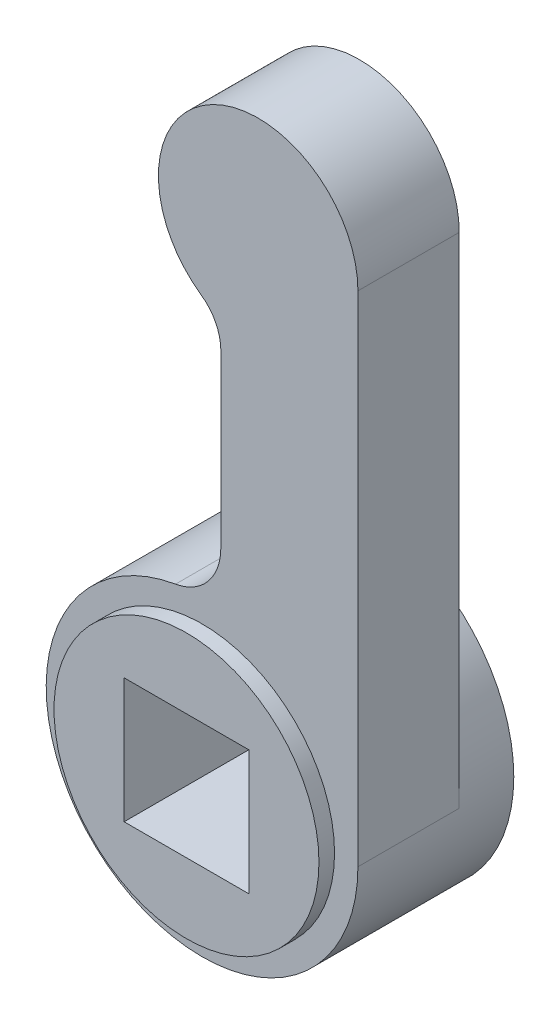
ISO-10303-21;
HEADER;
FILE_DESCRIPTION(('STEP AP214'),'2;1');
FILE_NAME('part.step','',(''),(''),'','','');
FILE_SCHEMA(('AUTOMOTIVE_DESIGN { 1 0 10303 214 1 1 1 1 }'));
ENDSEC;
DATA;
#1=APPLICATION_CONTEXT('core data for automotive mechanical design processes');
#2=APPLICATION_PROTOCOL_DEFINITION('international standard','automotive_design',2000,#1);
#3=PRODUCT_CONTEXT('',#1,'mechanical');
#4=PRODUCT('Part','Part','',(#3));
#5=PRODUCT_RELATED_PRODUCT_CATEGORY('part','',(#4));
#6=PRODUCT_DEFINITION_FORMATION('','',#4);
#7=PRODUCT_DEFINITION_CONTEXT('part definition',#1,'design');
#8=PRODUCT_DEFINITION('design','',#6,#7);
#9=PRODUCT_DEFINITION_SHAPE('','',#8);
#10=(LENGTH_UNIT() NAMED_UNIT(*) SI_UNIT(.MILLI.,.METRE.));
#11=(NAMED_UNIT(*) PLANE_ANGLE_UNIT() SI_UNIT($,.RADIAN.));
#12=(NAMED_UNIT(*) SI_UNIT($,.STERADIAN.) SOLID_ANGLE_UNIT());
#13=UNCERTAINTY_MEASURE_WITH_UNIT(LENGTH_MEASURE(1.E-05),#10,'distance_accuracy_value','');
#14=(GEOMETRIC_REPRESENTATION_CONTEXT(3) GLOBAL_UNCERTAINTY_ASSIGNED_CONTEXT((#13)) GLOBAL_UNIT_ASSIGNED_CONTEXT((#10,
#11,#12)) REPRESENTATION_CONTEXT('',''));
#15=CARTESIAN_POINT('',(0.,0.,0.));
#16=DIRECTION('',(0.,0.,1.));
#17=DIRECTION('',(1.,0.,0.));
#18=AXIS2_PLACEMENT_3D('',#15,#16,#17);
#19=CARTESIAN_POINT('',(0.,0.,5.));
#20=DIRECTION('',(0.,0.,1.));
#21=DIRECTION('',(1.,0.,0.));
#22=AXIS2_PLACEMENT_3D('',#19,#20,#21);
#23=PLANE('',#22);
#24=CARTESIAN_POINT('',(0.,0.,5.));
#25=DIRECTION('',(0.,0.,1.));
#26=DIRECTION('',(1.,0.,0.));
#27=AXIS2_PLACEMENT_3D('',#24,#25,#26);
#28=CIRCLE('',#27,10.);
#29=CARTESIAN_POINT('',(-1.7009795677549,9.85427158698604,5.));
#30=VERTEX_POINT('',#29);
#31=CARTESIAN_POINT('',(10.,0.,5.));
#32=VERTEX_POINT('',#31);
#33=EDGE_CURVE('E38',#30,#32,#28,.T.);
#34=ORIENTED_EDGE('',*,*,#33,.T.);
#35=DIRECTION('',(0.,1.,0.));
#36=VECTOR('',#35,1.);
#37=CARTESIAN_POINT('',(10.,0.,5.));
#38=LINE('',#37,#36);
#39=CARTESIAN_POINT('',(9.99999999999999,32.,5.));
#40=VERTEX_POINT('',#39);
#41=EDGE_CURVE('E159',#32,#40,#38,.T.);
#42=ORIENTED_EDGE('',*,*,#41,.T.);
#43=CARTESIAN_POINT('',(3.59999999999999,32.,5.));
#44=DIRECTION('',(0.,0.,1.));
#45=DIRECTION('',(-1.,0.,0.));
#46=AXIS2_PLACEMENT_3D('',#43,#44,#45);
#47=CIRCLE('',#46,6.4);
#48=CARTESIAN_POINT('',(-0.0740918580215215,26.759670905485,5.));
#49=VERTEX_POINT('',#48);
#50=EDGE_CURVE('E162',#40,#49,#47,.T.);
#51=ORIENTED_EDGE('',*,*,#50,.T.);
#52=CARTESIAN_POINT('',(-1.79632241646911,24.3032666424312,5.));
#53=DIRECTION('',(0.,0.,-1.));
#54=DIRECTION('',(1.,0.,0.));
#55=AXIS2_PLACEMENT_3D('',#52,#53,#54);
#56=CIRCLE('',#55,3.);
#57=CARTESIAN_POINT('',(1.20367758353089,24.3032666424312,5.));
#58=VERTEX_POINT('',#57);
#59=EDGE_CURVE('E165',#49,#58,#56,.T.);
#60=ORIENTED_EDGE('',*,*,#59,.T.);
#61=DIRECTION('',(0.,-1.,0.));
#62=VECTOR('',#61,1.);
#63=CARTESIAN_POINT('',(1.20367758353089,13.3032666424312,5.));
#64=LINE('',#63,#62);
#65=CARTESIAN_POINT('',(1.20367758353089,13.3032666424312,5.));
#66=VERTEX_POINT('',#65);
#67=EDGE_CURVE('E168',#58,#66,#64,.T.);
#68=ORIENTED_EDGE('',*,*,#67,.T.);
#69=CARTESIAN_POINT('',(-2.29632241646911,13.3032666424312,5.));
#70=DIRECTION('',(0.,0.,-1.));
#71=DIRECTION('',(1.,0.,0.));
#72=AXIS2_PLACEMENT_3D('',#69,#70,#71);
#73=CIRCLE('',#72,3.5);
#74=EDGE_CURVE('E45',#66,#30,#73,.T.);
#75=ORIENTED_EDGE('',*,*,#74,.T.);
#76=EDGE_LOOP('',(#34,#42,#51,#60,#68,#75));
#77=FACE_BOUND('',#76,.T.);
#78=CARTESIAN_POINT('',(0.,0.,5.));
#79=DIRECTION('',(0.,0.,1.));
#80=DIRECTION('',(1.,0.,0.));
#81=AXIS2_PLACEMENT_3D('',#78,#79,#80);
#82=CIRCLE('',#81,8.5);
#83=CARTESIAN_POINT('',(8.5,0.,5.));
#84=VERTEX_POINT('',#83);
#85=EDGE_CURVE('E154',#84,#84,#82,.F.);
#86=ORIENTED_EDGE('',*,*,#85,.T.);
#87=EDGE_LOOP('',(#86));
#88=FACE_BOUND('',#87,.T.);
#89=ADVANCED_FACE('F30',(#77,#88),#23,.T.);
#90=CARTESIAN_POINT('',(0.,0.,-5.));
#91=DIRECTION('',(0.,0.,1.));
#92=DIRECTION('',(1.,0.,0.));
#93=AXIS2_PLACEMENT_3D('',#90,#91,#92);
#94=PLANE('',#93);
#95=CARTESIAN_POINT('',(0.,0.,-5.));
#96=DIRECTION('',(0.,0.,1.));
#97=DIRECTION('',(1.,0.,0.));
#98=AXIS2_PLACEMENT_3D('',#95,#96,#97);
#99=CIRCLE('',#98,10.);
#100=CARTESIAN_POINT('',(10.,0.,-5.));
#101=VERTEX_POINT('',#100);
#102=EDGE_CURVE('E122',#101,#101,#99,.T.);
#103=ORIENTED_EDGE('',*,*,#102,.F.);
#104=EDGE_LOOP('',(#103));
#105=FACE_BOUND('',#104,.T.);
#106=CARTESIAN_POINT('',(0.,0.,-5.));
#107=DIRECTION('',(0.,0.,1.));
#108=DIRECTION('',(1.,0.,0.));
#109=AXIS2_PLACEMENT_3D('',#106,#107,#108);
#110=CIRCLE('',#109,8.5);
#111=CARTESIAN_POINT('',(8.5,0.,-5.));
#112=VERTEX_POINT('',#111);
#113=EDGE_CURVE('E11',#112,#112,#110,.F.);
#114=ORIENTED_EDGE('',*,*,#113,.F.);
#115=EDGE_LOOP('',(#114));
#116=FACE_BOUND('',#115,.T.);
#117=ADVANCED_FACE('F208',(#105,#116),#94,.F.);
#118=CARTESIAN_POINT('',(0.,0.,5.));
#119=DIRECTION('',(0.,0.,-1.));
#120=DIRECTION('',(-1.,0.,0.));
#121=AXIS2_PLACEMENT_3D('',#118,#119,#120);
#122=CYLINDRICAL_SURFACE('',#121,10.);
#123=ORIENTED_EDGE('',*,*,#102,.T.);
#124=EDGE_LOOP('',(#123));
#125=FACE_BOUND('',#124,.T.);
#126=DIRECTION('',(0.,0.,1.));
#127=VECTOR('',#126,1.);
#128=CARTESIAN_POINT('',(-1.7009795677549,9.85427158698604,-1.5));
#129=LINE('',#128,#127);
#130=CARTESIAN_POINT('',(-1.7009795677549,9.85427158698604,-1.5));
#131=VERTEX_POINT('',#130);
#132=EDGE_CURVE('E187',#131,#30,#129,.T.);
#133=ORIENTED_EDGE('',*,*,#132,.F.);
#134=CARTESIAN_POINT('',(0.,0.,-1.5));
#135=DIRECTION('',(0.,0.,-1.));
#136=DIRECTION('',(-1.,0.,0.));
#137=AXIS2_PLACEMENT_3D('',#134,#135,#136);
#138=CIRCLE('',#137,10.);
#139=CARTESIAN_POINT('',(10.,0.,-1.5));
#140=VERTEX_POINT('',#139);
#141=EDGE_CURVE('E53',#131,#140,#138,.T.);
#142=ORIENTED_EDGE('',*,*,#141,.T.);
#143=DIRECTION('',(0.,0.,1.));
#144=VECTOR('',#143,1.);
#145=CARTESIAN_POINT('',(10.,0.,-1.5));
#146=LINE('',#145,#144);
#147=EDGE_CURVE('E186',#140,#32,#146,.T.);
#148=ORIENTED_EDGE('',*,*,#147,.T.);
#149=ORIENTED_EDGE('',*,*,#33,.F.);
#150=EDGE_LOOP('',(#133,#142,#148,#149));
#151=FACE_BOUND('',#150,.T.);
#152=ADVANCED_FACE('F32',(#125,#151),#122,.T.);
#153=CARTESIAN_POINT('',(-2.29632241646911,13.3032666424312,-1.5));
#154=DIRECTION('',(0.,0.,1.));
#155=DIRECTION('',(1.,0.,0.));
#156=AXIS2_PLACEMENT_3D('',#153,#154,#155);
#157=CYLINDRICAL_SURFACE('',#156,3.5);
#158=ORIENTED_EDGE('',*,*,#132,.T.);
#159=ORIENTED_EDGE('',*,*,#74,.F.);
#160=DIRECTION('',(0.,0.,1.));
#161=VECTOR('',#160,1.);
#162=CARTESIAN_POINT('',(1.20367758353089,13.3032666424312,-1.5));
#163=LINE('',#162,#161);
#164=CARTESIAN_POINT('',(1.20367758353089,13.3032666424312,-1.5));
#165=VERTEX_POINT('',#164);
#166=EDGE_CURVE('E189',#165,#66,#163,.T.);
#167=ORIENTED_EDGE('',*,*,#166,.F.);
#168=CARTESIAN_POINT('',(-2.29632241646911,13.3032666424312,-1.5));
#169=DIRECTION('',(0.,0.,-1.));
#170=DIRECTION('',(1.,0.,0.));
#171=AXIS2_PLACEMENT_3D('',#168,#169,#170);
#172=CIRCLE('',#171,3.5);
#173=EDGE_CURVE('E184',#165,#131,#172,.T.);
#174=ORIENTED_EDGE('',*,*,#173,.T.);
#175=EDGE_LOOP('',(#158,#159,#167,#174));
#176=FACE_BOUND('',#175,.T.);
#177=ADVANCED_FACE('F264',(#176),#157,.F.);
#178=CARTESIAN_POINT('',(1.20367758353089,13.3032666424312,-1.5));
#179=DIRECTION('',(-1.,0.,0.));
#180=DIRECTION('',(0.,0.,1.));
#181=AXIS2_PLACEMENT_3D('',#178,#179,#180);
#182=PLANE('',#181);
#183=ORIENTED_EDGE('',*,*,#166,.T.);
#184=ORIENTED_EDGE('',*,*,#67,.F.);
#185=DIRECTION('',(0.,0.,1.));
#186=VECTOR('',#185,1.);
#187=CARTESIAN_POINT('',(1.20367758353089,24.3032666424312,-1.5));
#188=LINE('',#187,#186);
#189=CARTESIAN_POINT('',(1.20367758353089,24.3032666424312,-1.5));
#190=VERTEX_POINT('',#189);
#191=EDGE_CURVE('E191',#190,#58,#188,.T.);
#192=ORIENTED_EDGE('',*,*,#191,.F.);
#193=DIRECTION('',(0.,-1.,0.));
#194=VECTOR('',#193,1.);
#195=CARTESIAN_POINT('',(1.20367758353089,13.3032666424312,-1.5));
#196=LINE('',#195,#194);
#197=EDGE_CURVE('E181',#190,#165,#196,.T.);
#198=ORIENTED_EDGE('',*,*,#197,.T.);
#199=EDGE_LOOP('',(#183,#184,#192,#198));
#200=FACE_BOUND('',#199,.T.);
#201=ADVANCED_FACE('F260',(#200),#182,.T.);
#202=CARTESIAN_POINT('',(-1.79632241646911,24.3032666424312,-1.5));
#203=DIRECTION('',(0.,0.,1.));
#204=DIRECTION('',(1.,0.,0.));
#205=AXIS2_PLACEMENT_3D('',#202,#203,#204);
#206=CYLINDRICAL_SURFACE('',#205,3.);
#207=ORIENTED_EDGE('',*,*,#191,.T.);
#208=ORIENTED_EDGE('',*,*,#59,.F.);
#209=DIRECTION('',(0.,0.,1.));
#210=VECTOR('',#209,1.);
#211=CARTESIAN_POINT('',(-0.0740918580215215,26.759670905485,-1.5));
#212=LINE('',#211,#210);
#213=CARTESIAN_POINT('',(-0.0740918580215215,26.759670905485,-1.5));
#214=VERTEX_POINT('',#213);
#215=EDGE_CURVE('E193',#214,#49,#212,.T.);
#216=ORIENTED_EDGE('',*,*,#215,.F.);
#217=CARTESIAN_POINT('',(-1.79632241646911,24.3032666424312,-1.5));
#218=DIRECTION('',(0.,0.,-1.));
#219=DIRECTION('',(1.,0.,0.));
#220=AXIS2_PLACEMENT_3D('',#217,#218,#219);
#221=CIRCLE('',#220,3.);
#222=EDGE_CURVE('E178',#214,#190,#221,.T.);
#223=ORIENTED_EDGE('',*,*,#222,.T.);
#224=EDGE_LOOP('',(#207,#208,#216,#223));
#225=FACE_BOUND('',#224,.T.);
#226=ADVANCED_FACE('F256',(#225),#206,.F.);
#227=CARTESIAN_POINT('',(3.59999999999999,32.,-1.5));
#228=DIRECTION('',(0.,0.,1.));
#229=DIRECTION('',(1.,0.,0.));
#230=AXIS2_PLACEMENT_3D('',#227,#228,#229);
#231=CYLINDRICAL_SURFACE('',#230,6.4);
#232=ORIENTED_EDGE('',*,*,#215,.T.);
#233=ORIENTED_EDGE('',*,*,#50,.F.);
#234=DIRECTION('',(0.,0.,1.));
#235=VECTOR('',#234,1.);
#236=CARTESIAN_POINT('',(9.99999999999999,32.,-1.5));
#237=LINE('',#236,#235);
#238=CARTESIAN_POINT('',(9.99999999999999,32.,-1.5));
#239=VERTEX_POINT('',#238);
#240=EDGE_CURVE('E195',#239,#40,#237,.T.);
#241=ORIENTED_EDGE('',*,*,#240,.F.);
#242=CARTESIAN_POINT('',(3.59999999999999,32.,-1.5));
#243=DIRECTION('',(0.,0.,1.));
#244=DIRECTION('',(-1.,0.,0.));
#245=AXIS2_PLACEMENT_3D('',#242,#243,#244);
#246=CIRCLE('',#245,6.4);
#247=EDGE_CURVE('E175',#239,#214,#246,.T.);
#248=ORIENTED_EDGE('',*,*,#247,.T.);
#249=EDGE_LOOP('',(#232,#233,#241,#248));
#250=FACE_BOUND('',#249,.T.);
#251=ADVANCED_FACE('F252',(#250),#231,.T.);
#252=CARTESIAN_POINT('',(10.,0.,-1.5));
#253=DIRECTION('',(1.,0.,0.));
#254=DIRECTION('',(0.,1.,0.));
#255=AXIS2_PLACEMENT_3D('',#252,#253,#254);
#256=PLANE('',#255);
#257=ORIENTED_EDGE('',*,*,#240,.T.);
#258=ORIENTED_EDGE('',*,*,#41,.F.);
#259=ORIENTED_EDGE('',*,*,#147,.F.);
#260=DIRECTION('',(0.,1.,0.));
#261=VECTOR('',#260,1.);
#262=CARTESIAN_POINT('',(10.,0.,-1.5));
#263=LINE('',#262,#261);
#264=EDGE_CURVE('E172',#140,#239,#263,.T.);
#265=ORIENTED_EDGE('',*,*,#264,.T.);
#266=EDGE_LOOP('',(#257,#258,#259,#265));
#267=FACE_BOUND('',#266,.T.);
#268=ADVANCED_FACE('F227',(#267),#256,.T.);
#269=CARTESIAN_POINT('',(0.,0.,-1.5));
#270=DIRECTION('',(0.,0.,-1.));
#271=DIRECTION('',(-1.,0.,0.));
#272=AXIS2_PLACEMENT_3D('',#269,#270,#271);
#273=PLANE('',#272);
#274=ORIENTED_EDGE('',*,*,#141,.F.);
#275=ORIENTED_EDGE('',*,*,#173,.F.);
#276=ORIENTED_EDGE('',*,*,#197,.F.);
#277=ORIENTED_EDGE('',*,*,#222,.F.);
#278=ORIENTED_EDGE('',*,*,#247,.F.);
#279=ORIENTED_EDGE('',*,*,#264,.F.);
#280=EDGE_LOOP('',(#274,#275,#276,#277,#278,#279));
#281=FACE_BOUND('',#280,.T.);
#282=ADVANCED_FACE('F216',(#281),#273,.T.);
#283=CARTESIAN_POINT('',(0.,0.,6.));
#284=DIRECTION('',(0.,0.,-1.));
#285=DIRECTION('',(-1.,0.,0.));
#286=AXIS2_PLACEMENT_3D('',#283,#284,#285);
#287=CYLINDRICAL_SURFACE('',#286,8.5);
#288=CARTESIAN_POINT('',(0.,0.,-6.));
#289=DIRECTION('',(0.,0.,1.));
#290=DIRECTION('',(1.,0.,0.));
#291=AXIS2_PLACEMENT_3D('',#288,#289,#290);
#292=CIRCLE('',#291,8.5);
#293=CARTESIAN_POINT('',(8.5,0.,-6.));
#294=VERTEX_POINT('',#293);
#295=EDGE_CURVE('E142',#294,#294,#292,.T.);
#296=ORIENTED_EDGE('',*,*,#295,.T.);
#297=EDGE_LOOP('',(#296));
#298=FACE_BOUND('',#297,.T.);
#299=ORIENTED_EDGE('',*,*,#113,.T.);
#300=EDGE_LOOP('',(#299));
#301=FACE_BOUND('',#300,.T.);
#302=ADVANCED_FACE('F213',(#298,#301),#287,.T.);
#303=CARTESIAN_POINT('',(0.,0.,-6.));
#304=DIRECTION('',(0.,0.,1.));
#305=DIRECTION('',(1.,0.,0.));
#306=AXIS2_PLACEMENT_3D('',#303,#304,#305);
#307=PLANE('',#306);
#308=ORIENTED_EDGE('',*,*,#295,.F.);
#309=EDGE_LOOP('',(#308));
#310=FACE_BOUND('',#309,.T.);
#311=DIRECTION('',(0.,1.,0.));
#312=VECTOR('',#311,1.);
#313=CARTESIAN_POINT('',(4.,4.,-6.));
#314=LINE('',#313,#312);
#315=CARTESIAN_POINT('',(4.,-4.,-6.));
#316=VERTEX_POINT('',#315);
#317=CARTESIAN_POINT('',(4.,4.,-6.));
#318=VERTEX_POINT('',#317);
#319=EDGE_CURVE('E143',#316,#318,#314,.T.);
#320=ORIENTED_EDGE('',*,*,#319,.T.);
#321=DIRECTION('',(-1.,0.,0.));
#322=VECTOR('',#321,1.);
#323=CARTESIAN_POINT('',(-4.,4.,-6.));
#324=LINE('',#323,#322);
#325=CARTESIAN_POINT('',(-4.,4.,-6.));
#326=VERTEX_POINT('',#325);
#327=EDGE_CURVE('E118',#318,#326,#324,.T.);
#328=ORIENTED_EDGE('',*,*,#327,.T.);
#329=DIRECTION('',(0.,-1.,0.));
#330=VECTOR('',#329,1.);
#331=CARTESIAN_POINT('',(-4.,4.,-6.));
#332=LINE('',#331,#330);
#333=CARTESIAN_POINT('',(-4.,-4.,-6.));
#334=VERTEX_POINT('',#333);
#335=EDGE_CURVE('E146',#326,#334,#332,.T.);
#336=ORIENTED_EDGE('',*,*,#335,.T.);
#337=DIRECTION('',(1.,0.,0.));
#338=VECTOR('',#337,1.);
#339=CARTESIAN_POINT('',(-4.,-4.,-6.));
#340=LINE('',#339,#338);
#341=EDGE_CURVE('E132',#334,#316,#340,.T.);
#342=ORIENTED_EDGE('',*,*,#341,.T.);
#343=EDGE_LOOP('',(#320,#328,#336,#342));
#344=FACE_BOUND('',#343,.T.);
#345=ADVANCED_FACE('F215',(#310,#344),#307,.F.);
#346=CARTESIAN_POINT('',(-4.,-4.,5.));
#347=DIRECTION('',(0.,1.,0.));
#348=DIRECTION('',(0.,0.,1.));
#349=AXIS2_PLACEMENT_3D('',#346,#347,#348);
#350=PLANE('',#349);
#351=DIRECTION('',(0.,0.,-1.));
#352=VECTOR('',#351,1.);
#353=CARTESIAN_POINT('',(4.,-4.,5.));
#354=LINE('',#353,#352);
#355=CARTESIAN_POINT('',(4.,-4.,6.));
#356=VERTEX_POINT('',#355);
#357=EDGE_CURVE('E128',#356,#316,#354,.T.);
#358=ORIENTED_EDGE('',*,*,#357,.T.);
#359=ORIENTED_EDGE('',*,*,#341,.F.);
#360=DIRECTION('',(0.,0.,-1.));
#361=VECTOR('',#360,1.);
#362=CARTESIAN_POINT('',(-4.,-4.,5.));
#363=LINE('',#362,#361);
#364=CARTESIAN_POINT('',(-4.,-4.,6.));
#365=VERTEX_POINT('',#364);
#366=EDGE_CURVE('E200',#365,#334,#363,.T.);
#367=ORIENTED_EDGE('',*,*,#366,.F.);
#368=DIRECTION('',(1.,0.,0.));
#369=VECTOR('',#368,1.);
#370=CARTESIAN_POINT('',(-4.,-4.,6.));
#371=LINE('',#370,#369);
#372=EDGE_CURVE('E138',#365,#356,#371,.T.);
#373=ORIENTED_EDGE('',*,*,#372,.T.);
#374=EDGE_LOOP('',(#358,#359,#367,#373));
#375=FACE_BOUND('',#374,.T.);
#376=ADVANCED_FACE('F224',(#375),#350,.T.);
#377=CARTESIAN_POINT('',(-4.,4.,5.));
#378=DIRECTION('',(1.,0.,0.));
#379=DIRECTION('',(0.,1.,0.));
#380=AXIS2_PLACEMENT_3D('',#377,#378,#379);
#381=PLANE('',#380);
#382=ORIENTED_EDGE('',*,*,#366,.T.);
#383=ORIENTED_EDGE('',*,*,#335,.F.);
#384=DIRECTION('',(0.,0.,-1.));
#385=VECTOR('',#384,1.);
#386=CARTESIAN_POINT('',(-4.,4.,5.));
#387=LINE('',#386,#385);
#388=CARTESIAN_POINT('',(-4.,4.,6.));
#389=VERTEX_POINT('',#388);
#390=EDGE_CURVE('E123',#389,#326,#387,.T.);
#391=ORIENTED_EDGE('',*,*,#390,.F.);
#392=DIRECTION('',(0.,-1.,0.));
#393=VECTOR('',#392,1.);
#394=CARTESIAN_POINT('',(-4.,4.,6.));
#395=LINE('',#394,#393);
#396=EDGE_CURVE('E136',#389,#365,#395,.T.);
#397=ORIENTED_EDGE('',*,*,#396,.T.);
#398=EDGE_LOOP('',(#382,#383,#391,#397));
#399=FACE_BOUND('',#398,.T.);
#400=ADVANCED_FACE('F243',(#399),#381,.T.);
#401=CARTESIAN_POINT('',(-4.,4.,5.));
#402=DIRECTION('',(0.,-1.,0.));
#403=DIRECTION('',(0.,0.,-1.));
#404=AXIS2_PLACEMENT_3D('',#401,#402,#403);
#405=PLANE('',#404);
#406=ORIENTED_EDGE('',*,*,#390,.T.);
#407=ORIENTED_EDGE('',*,*,#327,.F.);
#408=DIRECTION('',(0.,0.,-1.));
#409=VECTOR('',#408,1.);
#410=CARTESIAN_POINT('',(4.,4.,5.));
#411=LINE('',#410,#409);
#412=CARTESIAN_POINT('',(4.,4.,6.));
#413=VERTEX_POINT('',#412);
#414=EDGE_CURVE('E111',#413,#318,#411,.T.);
#415=ORIENTED_EDGE('',*,*,#414,.F.);
#416=DIRECTION('',(-1.,0.,0.));
#417=VECTOR('',#416,1.);
#418=CARTESIAN_POINT('',(-4.,4.,6.));
#419=LINE('',#418,#417);
#420=EDGE_CURVE('E115',#413,#389,#419,.T.);
#421=ORIENTED_EDGE('',*,*,#420,.T.);
#422=EDGE_LOOP('',(#406,#407,#415,#421));
#423=FACE_BOUND('',#422,.T.);
#424=ADVANCED_FACE('F113',(#423),#405,.T.);
#425=CARTESIAN_POINT('',(4.,4.,5.));
#426=DIRECTION('',(-1.,0.,0.));
#427=DIRECTION('',(0.,-1.,0.));
#428=AXIS2_PLACEMENT_3D('',#425,#426,#427);
#429=PLANE('',#428);
#430=ORIENTED_EDGE('',*,*,#414,.T.);
#431=ORIENTED_EDGE('',*,*,#319,.F.);
#432=ORIENTED_EDGE('',*,*,#357,.F.);
#433=DIRECTION('',(0.,1.,0.));
#434=VECTOR('',#433,1.);
#435=CARTESIAN_POINT('',(4.,4.,6.));
#436=LINE('',#435,#434);
#437=EDGE_CURVE('E126',#356,#413,#436,.T.);
#438=ORIENTED_EDGE('',*,*,#437,.T.);
#439=EDGE_LOOP('',(#430,#431,#432,#438));
#440=FACE_BOUND('',#439,.T.);
#441=ADVANCED_FACE('F127',(#440),#429,.T.);
#442=CARTESIAN_POINT('',(0.,0.,6.));
#443=DIRECTION('',(0.,0.,1.));
#444=DIRECTION('',(1.,0.,0.));
#445=AXIS2_PLACEMENT_3D('',#442,#443,#444);
#446=PLANE('',#445);
#447=CARTESIAN_POINT('',(0.,0.,6.));
#448=DIRECTION('',(0.,0.,1.));
#449=DIRECTION('',(1.,0.,0.));
#450=AXIS2_PLACEMENT_3D('',#447,#448,#449);
#451=CIRCLE('',#450,8.5);
#452=CARTESIAN_POINT('',(8.5,0.,6.));
#453=VERTEX_POINT('',#452);
#454=EDGE_CURVE('E151',#453,#453,#451,.T.);
#455=ORIENTED_EDGE('',*,*,#454,.T.);
#456=EDGE_LOOP('',(#455));
#457=FACE_BOUND('',#456,.T.);
#458=ORIENTED_EDGE('',*,*,#420,.F.);
#459=ORIENTED_EDGE('',*,*,#437,.F.);
#460=ORIENTED_EDGE('',*,*,#372,.F.);
#461=ORIENTED_EDGE('',*,*,#396,.F.);
#462=EDGE_LOOP('',(#458,#459,#460,#461));
#463=FACE_BOUND('',#462,.T.);
#464=ADVANCED_FACE('F134',(#457,#463),#446,.T.);
#465=ORIENTED_EDGE('',*,*,#85,.F.);
#466=EDGE_LOOP('',(#465));
#467=FACE_BOUND('',#466,.T.);
#468=ORIENTED_EDGE('',*,*,#454,.F.);
#469=EDGE_LOOP('',(#468));
#470=FACE_BOUND('',#469,.T.);
#471=ADVANCED_FACE('F219',(#467,#470),#287,.T.);
#472=CLOSED_SHELL('',(#89,#117,#152,#177,#201,#226,#251,#268,#282,#302,#345,#376,#400,#424,#441,
#464,#471));
#473=MANIFOLD_SOLID_BREP('B2',#472);
#474=ADVANCED_BREP_SHAPE_REPRESENTATION('',(#18,#473),#14);
#475=SHAPE_DEFINITION_REPRESENTATION(#9,#474);
ENDSEC;
END-ISO-10303-21;
